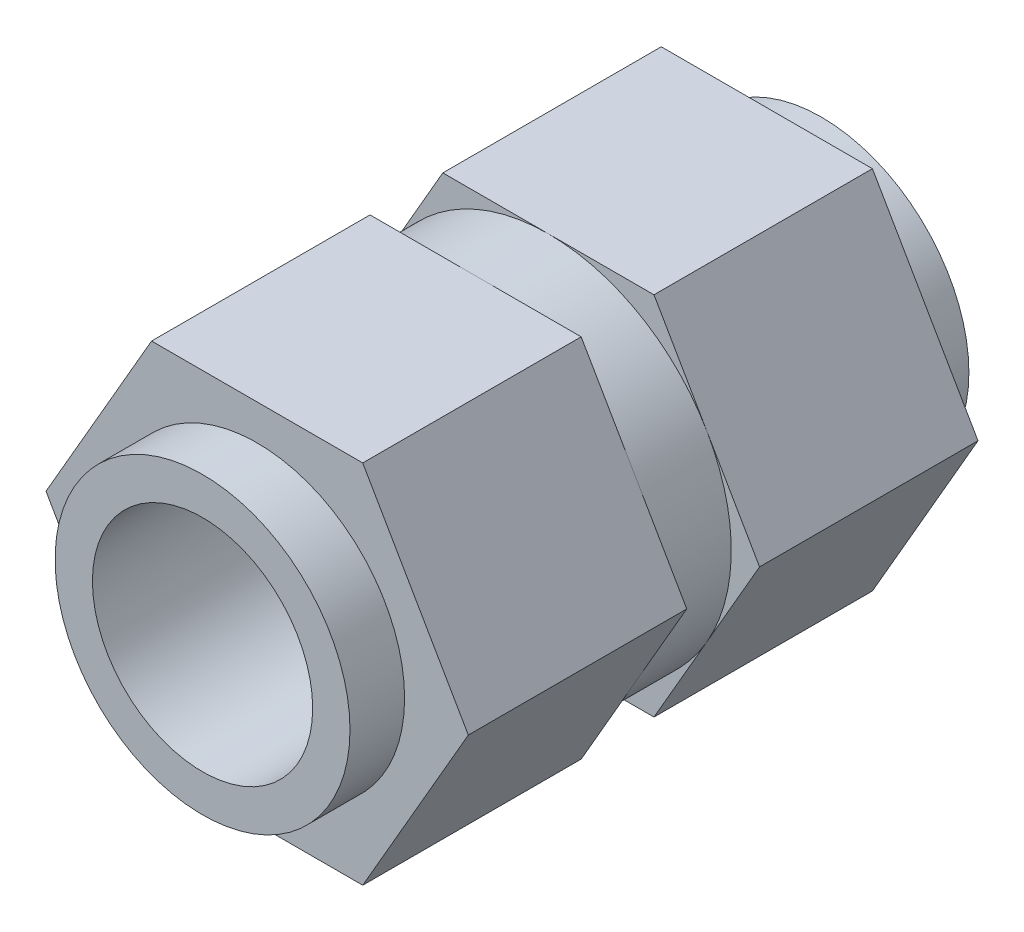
from build123d import *

# Parameters (mm, degrees)
BOSS_EXTRUDE1_DEPTH = 6
SKETCH3_R           = 5.022947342
BOSS_EXTRUDE2_DEPTH = 2
BOSS_EXTRUDE3_DEPTH = 6
SKETCH5_R           = 4.05
BOSS_EXTRUDE4_DEPTH = 1.5
SKETCH6_R           = 2.5
CUT_EXTRUDE1_DEPTH  = 1
SKETCH7_R           = 1.5
CUT_EXTRUDE2_DEPTH  = 1.75
SKETCH8_R           = 3.025
CUT_EXTRUDE3_DEPTH  = 12.75
BOSS_EXTRUDE5_START = 1.5
SKETCH9_R           = 4.05
SKETCH9_R_2         = 3.025
BOSS_EXTRUDE5_DEPTH = 1.5


with BuildPart() as part:
    # Sketch1 → Boss-Extrude1 (new body)
    with BuildSketch(Plane.XY):
        Polygon((5.8, 0), (2.9, 5.022947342), (-2.9, 5.022947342), (-5.8, 0), (-2.9, -5.022947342), (2.9, -5.022947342), align=None)
    extrude(amount=BOSS_EXTRUDE1_DEPTH)

    # Sketch3 → Boss-Extrude2 (add)
    with BuildSketch(Plane.XY.offset(6)):
        with Locations(Location((0, 0, 0), (0, 0, 150))):
            Circle(SKETCH3_R)
    extrude(amount=BOSS_EXTRUDE2_DEPTH)

    # Sketch4 → Boss-Extrude3 (add)
    with BuildSketch(Plane.XY.offset(8)):
        Polygon((-5.8, 0), (-2.9, -5.022947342), (2.9, -5.022947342), (5.8, 0), (2.9, 5.022947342), (-2.9, 5.022947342), align=None)
    extrude(amount=BOSS_EXTRUDE3_DEPTH)

    # Sketch5 → Boss-Extrude4 (add)
    with BuildSketch(Plane(origin=(0, 0, 0), x_dir=(-1, 0, 0), z_dir=(0, 0, -1))):
        with Locations(Location((0, 0, 0), (0, 0, 180))):
            Circle(SKETCH5_R)
    extrude(amount=BOSS_EXTRUDE4_DEPTH)

    # Sketch6 → Cut-Extrude1 (cut)
    with BuildSketch(Plane(origin=(0, 0, -1.5), x_dir=(-1, 0, 0), z_dir=(0, 0, -1))):
        Circle(SKETCH6_R)
    extrude(amount=-CUT_EXTRUDE1_DEPTH, mode=Mode.SUBTRACT)

    # Sketch7 → Cut-Extrude2 (cut)
    with BuildSketch(Plane(origin=(0, 0, -0.5), x_dir=(-1, 0, 0), z_dir=(0, 0, -1))):
        Circle(SKETCH7_R)
    extrude(amount=-CUT_EXTRUDE2_DEPTH, mode=Mode.SUBTRACT)

    # Sketch8 → Cut-Extrude3 (cut)
    with BuildSketch(Plane.XY.offset(14)):
        Circle(SKETCH8_R)
    extrude(amount=-CUT_EXTRUDE3_DEPTH, mode=Mode.SUBTRACT)

    # Sketch9 → Boss-Extrude5 (add)
    with BuildSketch(Plane.XY.offset(14).offset(BOSS_EXTRUDE5_START)):
        Circle(SKETCH9_R)
        Circle(SKETCH9_R_2, mode=Mode.SUBTRACT)
    extrude(amount=-BOSS_EXTRUDE5_DEPTH)


solid = part.part
